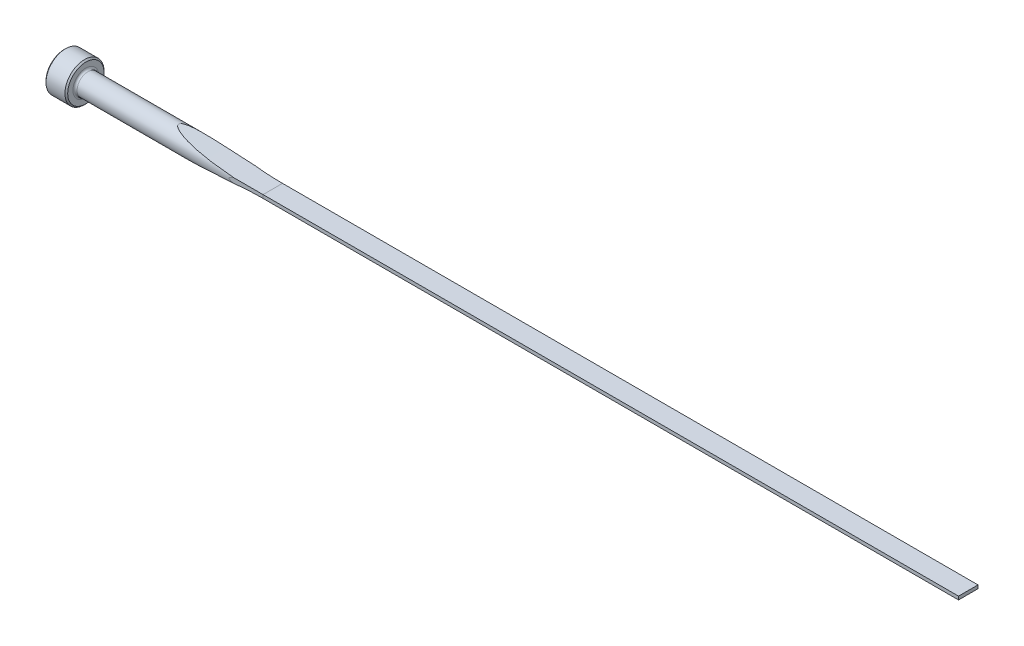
ISO-10303-21;
HEADER;
FILE_DESCRIPTION(('STEP AP214'),'2;1');
FILE_NAME('part.step','',(''),(''),'','','');
FILE_SCHEMA(('AUTOMOTIVE_DESIGN { 1 0 10303 214 1 1 1 1 }'));
ENDSEC;
DATA;
#1=APPLICATION_CONTEXT('core data for automotive mechanical design processes');
#2=APPLICATION_PROTOCOL_DEFINITION('international standard','automotive_design',2000,#1);
#3=PRODUCT_CONTEXT('',#1,'mechanical');
#4=PRODUCT('Part','Part','',(#3));
#5=PRODUCT_RELATED_PRODUCT_CATEGORY('part','',(#4));
#6=PRODUCT_DEFINITION_FORMATION('','',#4);
#7=PRODUCT_DEFINITION_CONTEXT('part definition',#1,'design');
#8=PRODUCT_DEFINITION('design','',#6,#7);
#9=PRODUCT_DEFINITION_SHAPE('','',#8);
#10=(LENGTH_UNIT() NAMED_UNIT(*) SI_UNIT(.MILLI.,.METRE.));
#11=(NAMED_UNIT(*) PLANE_ANGLE_UNIT() SI_UNIT($,.RADIAN.));
#12=(NAMED_UNIT(*) SI_UNIT($,.STERADIAN.) SOLID_ANGLE_UNIT());
#13=UNCERTAINTY_MEASURE_WITH_UNIT(LENGTH_MEASURE(1.E-05),#10,'distance_accuracy_value','');
#14=(GEOMETRIC_REPRESENTATION_CONTEXT(3) GLOBAL_UNCERTAINTY_ASSIGNED_CONTEXT((#13)) GLOBAL_UNIT_ASSIGNED_CONTEXT((#10,
#11,#12)) REPRESENTATION_CONTEXT('',''));
#15=CARTESIAN_POINT('',(0.,0.,0.));
#16=DIRECTION('',(0.,0.,1.));
#17=DIRECTION('',(1.,0.,0.));
#18=AXIS2_PLACEMENT_3D('',#15,#16,#17);
#19=CARTESIAN_POINT('',(0.,0.,0.));
#20=DIRECTION('',(-1.,0.,0.));
#21=DIRECTION('',(0.,0.,1.));
#22=AXIS2_PLACEMENT_3D('',#19,#20,#21);
#23=CYLINDRICAL_SURFACE('',#22,1.9812);
#24=CARTESIAN_POINT('',(4.3434,0.,0.));
#25=DIRECTION('',(-1.,0.,0.));
#26=DIRECTION('',(0.,0.,1.));
#27=AXIS2_PLACEMENT_3D('',#24,#25,#26);
#28=CIRCLE('',#27,1.9812);
#29=CARTESIAN_POINT('',(4.3434,0.,1.9812));
#30=VERTEX_POINT('',#29);
#31=EDGE_CURVE('E152',#30,#30,#28,.F.);
#32=ORIENTED_EDGE('',*,*,#31,.T.);
#33=EDGE_LOOP('',(#32));
#34=FACE_BOUND('',#33,.T.);
#35=CARTESIAN_POINT('',(38.1,0.873996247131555,1.77799999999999));
#36=CARTESIAN_POINT('',(37.9334542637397,0.873989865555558,1.77799993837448));
#37=CARTESIAN_POINT('',(37.7669097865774,0.873044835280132,1.77846802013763));
#38=CARTESIAN_POINT('',(37.4338428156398,0.869223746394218,1.78033991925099));
#39=CARTESIAN_POINT('',(37.2673203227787,0.866347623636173,1.78174376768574));
#40=CARTESIAN_POINT('',(36.7674068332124,0.854732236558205,1.78736286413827));
#41=CARTESIAN_POINT('',(36.4340948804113,0.8430056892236,1.7929856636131));
#42=CARTESIAN_POINT('',(35.7727863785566,0.810634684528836,1.80785962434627));
#43=CARTESIAN_POINT('',(35.4447825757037,0.79012144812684,1.81705721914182));
#44=CARTESIAN_POINT('',(34.9536671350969,0.750641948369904,1.83354371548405));
#45=CARTESIAN_POINT('',(34.7901577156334,0.736036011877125,1.83948544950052));
#46=CARTESIAN_POINT('',(34.4635315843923,0.703289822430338,1.85225599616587));
#47=CARTESIAN_POINT('',(34.3004148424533,0.685149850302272,1.85908473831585));
#48=CARTESIAN_POINT('',(34.0296562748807,0.651228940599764,1.87116478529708));
#49=CARTESIAN_POINT('',(33.9218452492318,0.636713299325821,1.8761721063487));
#50=CARTESIAN_POINT('',(33.7065408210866,0.605233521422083,1.88656384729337));
#51=CARTESIAN_POINT('',(33.5990475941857,0.588268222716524,1.8919484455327));
#52=CARTESIAN_POINT('',(33.3835275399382,0.551010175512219,1.9031350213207));
#53=CARTESIAN_POINT('',(33.2755064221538,0.530685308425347,1.90894069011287));
#54=CARTESIAN_POINT('',(33.0604889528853,0.485692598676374,1.92088824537));
#55=CARTESIAN_POINT('',(32.9534914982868,0.461030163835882,1.92702970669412));
#56=CARTESIAN_POINT('',(32.7938896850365,0.418829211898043,1.93647603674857));
#57=CARTESIAN_POINT('',(32.7406123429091,0.403818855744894,1.93967803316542));
#58=CARTESIAN_POINT('',(32.6346066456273,0.371424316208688,1.94614386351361));
#59=CARTESIAN_POINT('',(32.5818801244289,0.354033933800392,1.94940783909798));
#60=CARTESIAN_POINT('',(32.4782386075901,0.316094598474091,1.95591437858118));
#61=CARTESIAN_POINT('',(32.4273101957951,0.295581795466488,1.95915679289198));
#62=CARTESIAN_POINT('',(32.3278405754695,0.249491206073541,1.9655736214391));
#63=CARTESIAN_POINT('',(32.2792877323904,0.223942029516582,1.96874831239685));
#64=CARTESIAN_POINT('',(32.2167619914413,0.181702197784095,1.97288277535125));
#65=CARTESIAN_POINT('',(32.1999648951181,0.169297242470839,1.97399869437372));
#66=CARTESIAN_POINT('',(32.1681376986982,0.142414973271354,1.97612145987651));
#67=CARTESIAN_POINT('',(32.1530993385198,0.127948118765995,1.97712881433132));
#68=CARTESIAN_POINT('',(32.1334076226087,0.104576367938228,1.97845199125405));
#69=CARTESIAN_POINT('',(32.1274666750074,0.0967736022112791,1.97885188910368));
#70=CARTESIAN_POINT('',(32.116621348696,0.0804504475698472,1.97958282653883));
#71=CARTESIAN_POINT('',(32.1117177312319,0.0719295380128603,1.9799138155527));
#72=CARTESIAN_POINT('',(32.1032905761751,0.0540450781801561,1.9804831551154));
#73=CARTESIAN_POINT('',(32.0997893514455,0.0446706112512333,1.98072000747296));
#74=CARTESIAN_POINT('',(32.0947628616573,0.0254116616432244,1.98106017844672));
#75=CARTESIAN_POINT('',(32.0932312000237,0.0155289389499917,1.98116392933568));
#76=CARTESIAN_POINT('',(32.0924621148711,-0.00283989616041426,1.98121601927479));
#77=CARTESIAN_POINT('',(32.0929156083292,-0.0113136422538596,1.98118529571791));
#78=CARTESIAN_POINT('',(32.0953671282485,-0.0280374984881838,1.98101929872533));
#79=CARTESIAN_POINT('',(32.0973672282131,-0.0362872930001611,1.98088388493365));
#80=CARTESIAN_POINT('',(32.1032599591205,-0.0541083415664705,1.98048527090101));
#81=CARTESIAN_POINT('',(32.1074720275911,-0.0635712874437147,1.98020051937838));
#82=CARTESIAN_POINT('',(32.1173271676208,-0.081709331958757,1.97953524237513));
#83=CARTESIAN_POINT('',(32.1229731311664,-0.0903827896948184,1.97915452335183));
#84=CARTESIAN_POINT('',(32.1399709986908,-0.113337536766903,1.97801031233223));
#85=CARTESIAN_POINT('',(32.1523792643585,-0.126821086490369,1.97717711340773));
#86=CARTESIAN_POINT('',(32.178895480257,-0.151968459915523,1.97540307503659));
#87=CARTESIAN_POINT('',(32.1930088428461,-0.163626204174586,1.97446189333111));
#88=CARTESIAN_POINT('',(32.2308983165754,-0.19208509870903,1.97194504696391));
#89=CARTESIAN_POINT('',(32.2554459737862,-0.207842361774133,1.97032379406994));
#90=CARTESIAN_POINT('',(32.3058684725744,-0.237095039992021,1.96701597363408));
#91=CARTESIAN_POINT('',(32.331746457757,-0.250584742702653,1.9653292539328));
#92=CARTESIAN_POINT('',(32.4107777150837,-0.288767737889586,1.96021411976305));
#93=CARTESIAN_POINT('',(32.4650936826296,-0.311024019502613,1.95674636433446));
#94=CARTESIAN_POINT('',(32.5833217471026,-0.354812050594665,1.94931073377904));
#95=CARTESIAN_POINT('',(32.6474477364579,-0.375730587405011,1.94534614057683));
#96=CARTESIAN_POINT('',(32.7766973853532,-0.41429027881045,1.93749827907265));
#97=CARTESIAN_POINT('',(32.8418214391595,-0.431930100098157,1.93361504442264));
#98=CARTESIAN_POINT('',(33.0383860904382,-0.481456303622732,1.92211396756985));
#99=CARTESIAN_POINT('',(33.1707045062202,-0.509845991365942,1.91466459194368));
#100=CARTESIAN_POINT('',(33.4364278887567,-0.560951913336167,1.90030665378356));
#101=CARTESIAN_POINT('',(33.5698330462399,-0.583667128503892,1.89339818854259));
#102=CARTESIAN_POINT('',(33.8371090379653,-0.624985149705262,1.88016424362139));
#103=CARTESIAN_POINT('',(33.9709789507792,-0.643593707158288,1.87383795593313));
#104=CARTESIAN_POINT('',(34.2612886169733,-0.680513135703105,1.86077894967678));
#105=CARTESIAN_POINT('',(34.4178028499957,-0.698266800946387,1.85415178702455));
#106=CARTESIAN_POINT('',(34.7312113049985,-0.730437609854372,1.84171312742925));
#107=CARTESIAN_POINT('',(34.8881055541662,-0.744854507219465,1.83590169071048));
#108=CARTESIAN_POINT('',(35.3593917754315,-0.78401015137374,1.81969752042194));
#109=CARTESIAN_POINT('',(35.674170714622,-0.804628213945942,1.81054467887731));
#110=CARTESIAN_POINT('',(36.303676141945,-0.83743822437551,1.79559337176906));
#111=CARTESIAN_POINT('',(36.6184017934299,-0.849644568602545,1.78978917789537));
#112=CARTESIAN_POINT('',(37.2480072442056,-0.866841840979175,1.78152544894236));
#113=CARTESIAN_POINT('',(37.562886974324,-0.8718348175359,1.77906496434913));
#114=CARTESIAN_POINT('',(37.9518520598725,-0.8738064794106,1.77809255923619));
#115=CARTESIAN_POINT('',(38.0259264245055,-0.873993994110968,1.77799996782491));
#116=CARTESIAN_POINT('',(38.1,-0.873996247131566,1.77799999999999));
#117=B_SPLINE_CURVE_WITH_KNOTS('',3,(#35,#36,#37,#38,#39,#40,#41,#42,#43,#44,#45,#46,#47,#48,
#49,#50,#51,#52,#53,#54,#55,#56,#57,#58,#59,#60,#61,#62,#63,#64,#65,#66,#67,#68,#69,#70,#71,#72,
#73,#74,#75,#76,#77,#78,#79,#80,#81,#82,#83,#84,#85,#86,#87,#88,#89,#90,#91,#92,#93,#94,#95,#96,
#97,#98,#99,#100,#101,#102,#103,#104,#105,#106,#107,#108,#109,#110,#111,#112,#113,#114,#115,
#116),.UNSPECIFIED.,.F.,.F.,(4,2,2,2,2,2,2,2,2,2,2,2,2,2,2,2,2,2,2,2,2,2,2,2,2,2,2,2,2,2,2,2,2,
2,2,2,2,2,2,2,4),(0.,0.499631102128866,0.999278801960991,1.9998489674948,2.98597077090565,
3.47874557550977,3.97148123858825,4.29815737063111,4.62498898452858,4.95514810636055,
5.28489848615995,5.4512016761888,5.61794656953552,5.78289019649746,5.94692252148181,
6.00956538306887,6.07190109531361,6.10128690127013,6.1306941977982,6.1605523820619,
6.1903133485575,6.21561974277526,6.24096012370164,6.27187252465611,6.30284777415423,
6.35756673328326,6.41246418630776,6.49988097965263,6.58751479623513,6.76361391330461,
6.96621737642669,7.16890304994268,7.57526706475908,7.98170400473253,8.38756806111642,
8.86049226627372,9.33345136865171,10.2800238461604,11.2249722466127,12.1696522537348,
12.3918748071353),.UNSPECIFIED.);
#118=CARTESIAN_POINT('',(32.9338167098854,0.455036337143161,1.92823633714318));
#119=VERTEX_POINT('',#118);
#120=CARTESIAN_POINT('',(32.9338167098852,-0.455036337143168,1.92823633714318));
#121=VERTEX_POINT('',#120);
#122=EDGE_CURVE('E155',#119,#121,#117,.T.);
#123=ORIENTED_EDGE('',*,*,#122,.F.);
#124=CARTESIAN_POINT('',(38.1,0.30479999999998,1.95761344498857));
#125=CARTESIAN_POINT('',(37.7695529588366,0.304799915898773,1.95760214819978));
#126=CARTESIAN_POINT('',(37.4391059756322,0.306642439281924,1.95732626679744));
#127=CARTESIAN_POINT('',(36.7782488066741,0.314012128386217,1.95616343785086));
#128=CARTESIAN_POINT('',(36.4478386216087,0.319539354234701,1.955276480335));
#129=CARTESIAN_POINT('',(35.7873759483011,0.334271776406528,1.9528106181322));
#130=CARTESIAN_POINT('',(35.4573233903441,0.343473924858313,1.95123228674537));
#131=CARTESIAN_POINT('',(34.7973526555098,0.365554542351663,1.94721514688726));
#132=CARTESIAN_POINT('',(34.4674344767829,0.378432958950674,1.94477635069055));
#133=CARTESIAN_POINT('',(33.4774271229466,0.422603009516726,1.93584291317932));
#134=CARTESIAN_POINT('',(32.8175895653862,0.459418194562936,1.92773248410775));
#135=CARTESIAN_POINT('',(31.4988858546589,0.547752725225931,1.90452801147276));
#136=CARTESIAN_POINT('',(30.8400198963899,0.599274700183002,1.88943271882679));
#137=CARTESIAN_POINT('',(29.8521569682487,0.687610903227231,1.85830630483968));
#138=CARTESIAN_POINT('',(29.5225308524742,0.718944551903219,1.84649686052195));
#139=CARTESIAN_POINT('',(28.8637987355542,0.785276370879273,1.81928179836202));
#140=CARTESIAN_POINT('',(28.5346927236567,0.820274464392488,1.80387625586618));
#141=CARTESIAN_POINT('',(27.8772626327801,0.89390032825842,1.76854848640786));
#142=CARTESIAN_POINT('',(27.548938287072,0.932526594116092,1.74862812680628));
#143=CARTESIAN_POINT('',(26.8931454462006,1.01338569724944,1.70304380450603));
#144=CARTESIAN_POINT('',(26.5656769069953,1.05561834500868,1.67738014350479));
#145=CARTESIAN_POINT('',(25.9107084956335,1.14379434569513,1.6185564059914));
#146=CARTESIAN_POINT('',(25.5832125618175,1.18975022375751,1.58537028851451));
#147=CARTESIAN_POINT('',(25.0930833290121,1.26131005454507,1.52812761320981));
#148=CARTESIAN_POINT('',(24.9298235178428,1.28561189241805,1.50779256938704));
#149=CARTESIAN_POINT('',(24.6038270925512,1.33506408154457,1.46418845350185));
#150=CARTESIAN_POINT('',(24.4410904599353,1.36021440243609,1.44091948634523));
#151=CARTESIAN_POINT('',(24.1169309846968,1.41123193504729,1.3909878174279));
#152=CARTESIAN_POINT('',(23.9555054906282,1.43709587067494,1.36433908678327));
#153=CARTESIAN_POINT('',(23.6335346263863,1.48959050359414,1.30682557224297));
#154=CARTESIAN_POINT('',(23.4729891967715,1.51622114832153,1.27596107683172));
#155=CARTESIAN_POINT('',(23.1533253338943,1.57014271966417,1.2089879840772));
#156=CARTESIAN_POINT('',(22.994205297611,1.59743272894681,1.1728863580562));
#157=CARTESIAN_POINT('',(22.6777930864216,1.65257970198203,1.09383659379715));
#158=CARTESIAN_POINT('',(22.5205001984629,1.68043643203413,1.05089122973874));
#159=CARTESIAN_POINT('',(22.286608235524,1.72249921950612,0.979238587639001));
#160=CARTESIAN_POINT('',(22.2088921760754,1.73658373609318,0.95411361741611));
#161=CARTESIAN_POINT('',(22.0544398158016,1.76478536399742,0.90088724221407));
#162=CARTESIAN_POINT('',(21.9777040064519,1.77890248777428,0.872784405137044));
#163=CARTESIAN_POINT('',(21.825441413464,1.80711840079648,0.812762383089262));
#164=CARTESIAN_POINT('',(21.7499188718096,1.82121701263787,0.780832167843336));
#165=CARTESIAN_POINT('',(21.6011654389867,1.84918092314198,0.712082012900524));
#166=CARTESIAN_POINT('',(21.527932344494,1.86304643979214,0.675266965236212));
#167=CARTESIAN_POINT('',(21.384226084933,1.89043542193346,0.594374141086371));
#168=CARTESIAN_POINT('',(21.3137920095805,1.90395346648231,0.550221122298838));
#169=CARTESIAN_POINT('',(21.213895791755,1.92324041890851,0.476369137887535));
#170=CARTESIAN_POINT('',(21.1816570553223,1.92948463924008,0.450582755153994));
#171=CARTESIAN_POINT('',(21.1199681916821,1.94146580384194,0.395795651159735));
#172=CARTESIAN_POINT('',(21.0905122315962,1.94720380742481,0.366801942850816));
#173=CARTESIAN_POINT('',(21.0449514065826,1.95609990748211,0.315066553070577));
#174=CARTESIAN_POINT('',(21.0276518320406,1.95948383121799,0.293426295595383));
#175=CARTESIAN_POINT('',(20.9957337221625,1.96573570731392,0.248113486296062));
#176=CARTESIAN_POINT('',(20.9811174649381,1.9686032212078,0.224439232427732));
#177=CARTESIAN_POINT('',(20.9554498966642,1.9736440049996,0.174685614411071));
#178=CARTESIAN_POINT('',(20.9444506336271,1.97580713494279,0.148577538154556));
#179=CARTESIAN_POINT('',(20.9276253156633,1.97911786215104,0.0946961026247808));
#180=CARTESIAN_POINT('',(20.9217844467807,1.98026836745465,0.0669277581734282));
#181=CARTESIAN_POINT('',(20.9165018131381,1.98130891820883,0.0138732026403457));
#182=CARTESIAN_POINT('',(20.9164211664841,1.98132480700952,-0.0113459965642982));
#183=CARTESIAN_POINT('',(20.9210718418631,1.98040873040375,-0.0613254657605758));
#184=CARTESIAN_POINT('',(20.9258075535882,1.97947590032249,-0.0860852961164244));
#185=CARTESIAN_POINT('',(20.9402302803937,1.97663734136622,-0.137050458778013));
#186=CARTESIAN_POINT('',(20.9504133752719,1.97463416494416,-0.163106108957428));
#187=CARTESIAN_POINT('',(20.9747360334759,1.96985580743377,-0.213208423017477));
#188=CARTESIAN_POINT('',(20.9888827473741,1.96707923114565,-0.237251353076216));
#189=CARTESIAN_POINT('',(21.0304351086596,1.95893680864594,-0.29871400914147));
#190=CARTESIAN_POINT('',(21.0603806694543,1.95308118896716,-0.334326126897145));
#191=CARTESIAN_POINT('',(21.1248654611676,1.94051232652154,-0.400890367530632));
#192=CARTESIAN_POINT('',(21.1594183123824,1.93379654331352,-0.431828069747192));
#193=CARTESIAN_POINT('',(21.247369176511,1.91676173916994,-0.503050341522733));
#194=CARTESIAN_POINT('',(21.3023002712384,1.90617130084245,-0.541351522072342));
#195=CARTESIAN_POINT('',(21.4154712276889,1.88447103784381,-0.612617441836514));
#196=CARTESIAN_POINT('',(21.4737182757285,1.87336009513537,-0.645569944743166));
#197=CARTESIAN_POINT('',(21.5925740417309,1.85081574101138,-0.707621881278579));
#198=CARTESIAN_POINT('',(21.6531941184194,1.83938087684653,-0.736698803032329));
#199=CARTESIAN_POINT('',(21.7757398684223,1.81640018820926,-0.791659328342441));
#200=CARTESIAN_POINT('',(21.8376640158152,1.80485450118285,-0.817546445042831));
#201=CARTESIAN_POINT('',(22.023340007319,1.77044354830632,-0.890840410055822));
#202=CARTESIAN_POINT('',(22.1485077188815,1.74751721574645,-0.934620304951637));
#203=CARTESIAN_POINT('',(22.4010625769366,1.70182929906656,-1.01541106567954));
#204=CARTESIAN_POINT('',(22.5284511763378,1.67906783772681,-1.05241730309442));
#205=CARTESIAN_POINT('',(22.784941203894,1.63382325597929,-1.12137347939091));
#206=CARTESIAN_POINT('',(22.9140458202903,1.61134087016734,-1.15331194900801));
#207=CARTESIAN_POINT('',(23.1732653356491,1.56679514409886,-1.21313375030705));
#208=CARTESIAN_POINT('',(23.3033803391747,1.5447318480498,-1.24101665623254));
#209=CARTESIAN_POINT('',(23.5644971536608,1.50105606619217,-1.29350297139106));
#210=CARTESIAN_POINT('',(23.6954997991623,1.47944411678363,-1.31810264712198));
#211=CARTESIAN_POINT('',(23.9580829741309,1.43673132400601,-1.36453310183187));
#212=CARTESIAN_POINT('',(24.0896635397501,1.41563051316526,-1.38636370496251));
#213=CARTESIAN_POINT('',(24.3530824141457,1.37399668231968,-1.42763591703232));
#214=CARTESIAN_POINT('',(24.4849200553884,1.35346286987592,-1.44708100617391));
#215=CARTESIAN_POINT('',(24.748958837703,1.31294860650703,-1.48393649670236));
#216=CARTESIAN_POINT('',(24.8811599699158,1.29296814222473,-1.50134694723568));
#217=CARTESIAN_POINT('',(25.2723123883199,1.23475465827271,-1.55018456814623));
#218=CARTESIAN_POINT('',(25.53169601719,1.19731998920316,-1.57911231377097));
#219=CARTESIAN_POINT('',(26.0513195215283,1.12467659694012,-1.63164236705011));
#220=CARTESIAN_POINT('',(26.3115594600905,1.08946804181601,-1.65524427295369));
#221=CARTESIAN_POINT('',(26.832751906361,1.02130830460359,-1.69814758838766));
#222=CARTESIAN_POINT('',(27.0937045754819,0.98835768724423,-1.71744792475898));
#223=CARTESIAN_POINT('',(27.6161283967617,0.924747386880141,-1.75251500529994));
#224=CARTESIAN_POINT('',(27.8775995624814,0.894087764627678,-1.768281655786));
#225=CARTESIAN_POINT('',(28.6634038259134,0.805485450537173,-1.81126838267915));
#226=CARTESIAN_POINT('',(29.1883717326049,0.751018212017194,-1.83411690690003));
#227=CARTESIAN_POINT('',(30.2393832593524,0.651429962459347,-1.87179092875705));
#228=CARTESIAN_POINT('',(30.7654267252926,0.6063076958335,-1.88661750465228));
#229=CARTESIAN_POINT('',(31.8175815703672,0.525494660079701,-1.91070223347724));
#230=CARTESIAN_POINT('',(32.3436917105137,0.489790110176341,-1.9199685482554));
#231=CARTESIAN_POINT('',(33.3965332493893,0.427744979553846,-1.93473547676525));
#232=CARTESIAN_POINT('',(33.9232646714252,0.401404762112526,-1.94023594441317));
#233=CARTESIAN_POINT('',(34.976795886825,0.358115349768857,-1.94868973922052));
#234=CARTESIAN_POINT('',(35.5035954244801,0.341160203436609,-1.95164468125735));
#235=CARTESIAN_POINT('',(36.5574038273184,0.31662216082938,-1.95577596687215));
#236=CARTESIAN_POINT('',(37.0844126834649,0.309038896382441,-1.95695238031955));
#237=CARTESIAN_POINT('',(37.6928687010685,0.305694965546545,-1.95747371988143));
#238=CARTESIAN_POINT('',(37.774300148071,0.305359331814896,-1.95752618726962));
#239=CARTESIAN_POINT('',(37.9371543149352,0.304911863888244,-1.95759613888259));
#240=CARTESIAN_POINT('',(38.0185770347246,0.304800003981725,-1.95761362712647));
#241=CARTESIAN_POINT('',(38.1,0.304799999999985,-1.95761344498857));
#242=B_SPLINE_CURVE_WITH_KNOTS('',3,(#124,#125,#126,#127,#128,#129,#130,#131,#132,#133,#134,
#135,#136,#137,#138,#139,#140,#141,#142,#143,#144,#145,#146,#147,#148,#149,#150,#151,#152,#153,
#154,#155,#156,#157,#158,#159,#160,#161,#162,#163,#164,#165,#166,#167,#168,#169,#170,#171,#172,
#173,#174,#175,#176,#177,#178,#179,#180,#181,#182,#183,#184,#185,#186,#187,#188,#189,#190,#191,
#192,#193,#194,#195,#196,#197,#198,#199,#200,#201,#202,#203,#204,#205,#206,#207,#208,#209,#210,
#211,#212,#213,#214,#215,#216,#217,#218,#219,#220,#221,#222,#223,#224,#225,#226,#227,#228,#229,
#230,#231,#232,#233,#234,#235,#236,#237,#238,#239,#240,#241),.UNSPECIFIED.,.F.,.F.,(4,2,2,2,2,2,
2,2,2,2,2,2,2,2,2,2,2,2,2,2,2,2,2,2,2,2,2,2,2,2,2,2,2,2,2,2,2,2,2,2,2,2,2,2,2,2,2,2,2,2,2,2,2,2,
2,2,2,2,4),(0.,0.991335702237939,1.98268758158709,2.97321896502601,3.96373621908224,
5.94628404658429,7.92918654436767,8.92312202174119,9.91703667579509,10.9105409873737,
11.9039931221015,12.9009383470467,13.3998353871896,13.8987145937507,14.3955949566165,
14.892441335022,15.3886323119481,15.8846226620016,16.1332234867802,16.3819444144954,
16.6314002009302,16.8806080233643,17.1325496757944,17.2576650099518,17.3825119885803,
17.4660899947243,17.5497386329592,17.6345430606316,17.7191031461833,17.7942680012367,
17.8695014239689,17.9531791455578,18.0370088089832,18.1769027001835,18.3172197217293,
18.5201034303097,18.7234449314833,18.9279203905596,19.1321685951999,19.5355570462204,
19.939220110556,20.343784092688,20.748390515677,21.1534531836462,21.5585415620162,
21.9630317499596,22.3675121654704,23.1584106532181,23.9493687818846,24.7405240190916,
25.531700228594,27.1163456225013,28.7007779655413,30.2828788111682,31.8650410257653,
33.44619877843,35.027294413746,35.2715908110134,35.515859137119),.UNSPECIFIED.);
#243=CARTESIAN_POINT('',(32.9338167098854,0.455036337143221,-1.92823633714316));
#244=VERTEX_POINT('',#243);
#245=EDGE_CURVE('E105',#119,#244,#242,.T.);
#246=ORIENTED_EDGE('',*,*,#245,.T.);
#247=CARTESIAN_POINT('',(38.1,0.873996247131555,-1.77799999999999));
#248=CARTESIAN_POINT('',(37.9334542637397,0.873989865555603,-1.77799993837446));
#249=CARTESIAN_POINT('',(37.7669097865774,0.873044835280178,-1.77846802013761));
#250=CARTESIAN_POINT('',(37.4338428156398,0.869223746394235,-1.78033991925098));
#251=CARTESIAN_POINT('',(37.2673203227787,0.86634762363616,-1.78174376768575));
#252=CARTESIAN_POINT('',(36.7674068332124,0.854732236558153,-1.78736286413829));
#253=CARTESIAN_POINT('',(36.4340948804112,0.843005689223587,-1.7929856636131));
#254=CARTESIAN_POINT('',(35.7727863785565,0.81063468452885,-1.80785962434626));
#255=CARTESIAN_POINT('',(35.4447825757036,0.790121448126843,-1.81705721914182));
#256=CARTESIAN_POINT('',(34.9536671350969,0.750641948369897,-1.83354371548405));
#257=CARTESIAN_POINT('',(34.7901577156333,0.736036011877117,-1.83948544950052));
#258=CARTESIAN_POINT('',(34.4635315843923,0.703289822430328,-1.85225599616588));
#259=CARTESIAN_POINT('',(34.3004148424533,0.685149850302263,-1.85908473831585));
#260=CARTESIAN_POINT('',(34.0296562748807,0.651228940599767,-1.87116478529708));
#261=CARTESIAN_POINT('',(33.9218452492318,0.63671329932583,-1.8761721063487));
#262=CARTESIAN_POINT('',(33.7065408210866,0.605233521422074,-1.88656384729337));
#263=CARTESIAN_POINT('',(33.5990475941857,0.588268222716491,-1.89194844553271));
#264=CARTESIAN_POINT('',(33.3835275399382,0.551010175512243,-1.9031350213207));
#265=CARTESIAN_POINT('',(33.2755064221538,0.530685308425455,-1.90894069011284));
#266=CARTESIAN_POINT('',(33.0604889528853,0.485692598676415,-1.92088824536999));
#267=CARTESIAN_POINT('',(32.9534914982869,0.461030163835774,-1.92702970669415));
#268=CARTESIAN_POINT('',(32.7938896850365,0.418829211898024,-1.93647603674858));
#269=CARTESIAN_POINT('',(32.7406123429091,0.403818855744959,-1.93967803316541));
#270=CARTESIAN_POINT('',(32.6346066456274,0.37142431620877,-1.9461438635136));
#271=CARTESIAN_POINT('',(32.581880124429,0.354033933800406,-1.94940783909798));
#272=CARTESIAN_POINT('',(32.4782386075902,0.316094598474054,-1.95591437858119));
#273=CARTESIAN_POINT('',(32.4273101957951,0.295581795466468,-1.95915679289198));
#274=CARTESIAN_POINT('',(32.3278405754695,0.249491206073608,-1.96557362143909));
#275=CARTESIAN_POINT('',(32.2792877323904,0.223942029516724,-1.96874831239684));
#276=CARTESIAN_POINT('',(32.2167619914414,0.18170219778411,-1.97288277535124));
#277=CARTESIAN_POINT('',(32.1999648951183,0.169297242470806,-1.97399869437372));
#278=CARTESIAN_POINT('',(32.1681376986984,0.142414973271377,-1.97612145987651));
#279=CARTESIAN_POINT('',(32.15309933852,0.12794811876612,-1.97712881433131));
#280=CARTESIAN_POINT('',(32.1334076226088,0.104576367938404,-1.97845199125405));
#281=CARTESIAN_POINT('',(32.1274666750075,0.096773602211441,-1.97885188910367));
#282=CARTESIAN_POINT('',(32.1166213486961,0.0804504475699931,-1.97958282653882));
#283=CARTESIAN_POINT('',(32.1117177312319,0.0719295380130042,-1.9799138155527));
#284=CARTESIAN_POINT('',(32.1032905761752,0.0540450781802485,-1.9804831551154));
#285=CARTESIAN_POINT('',(32.0997893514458,0.0446706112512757,-1.98072000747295));
#286=CARTESIAN_POINT('',(32.0947628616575,0.0254116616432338,-1.98106017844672));
#287=CARTESIAN_POINT('',(32.0932312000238,0.015528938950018,-1.98116392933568));
#288=CARTESIAN_POINT('',(32.0924621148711,-0.00283989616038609,-1.98121601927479));
#289=CARTESIAN_POINT('',(32.0929156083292,-0.0113136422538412,-1.98118529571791));
#290=CARTESIAN_POINT('',(32.0953671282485,-0.0280374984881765,-1.98101929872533));
#291=CARTESIAN_POINT('',(32.0973672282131,-0.0362872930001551,-1.98088388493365));
#292=CARTESIAN_POINT('',(32.1032599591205,-0.0541083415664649,-1.98048527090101));
#293=CARTESIAN_POINT('',(32.1074720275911,-0.0635712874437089,-1.98020051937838));
#294=CARTESIAN_POINT('',(32.1173271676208,-0.0817093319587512,-1.97953524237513));
#295=CARTESIAN_POINT('',(32.1229731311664,-0.0903827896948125,-1.97915452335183));
#296=CARTESIAN_POINT('',(32.1399709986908,-0.1133375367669,-1.97801031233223));
#297=CARTESIAN_POINT('',(32.1523792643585,-0.126821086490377,-1.97717711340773));
#298=CARTESIAN_POINT('',(32.1788954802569,-0.151968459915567,-1.97540307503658));
#299=CARTESIAN_POINT('',(32.193008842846,-0.163626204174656,-1.9744618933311));
#300=CARTESIAN_POINT('',(32.2308983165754,-0.192085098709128,-1.9719450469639));
#301=CARTESIAN_POINT('',(32.2554459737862,-0.207842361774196,-1.97032379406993));
#302=CARTESIAN_POINT('',(32.3058684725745,-0.237095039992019,-1.96701597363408));
#303=CARTESIAN_POINT('',(32.3317464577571,-0.250584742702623,-1.96532925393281));
#304=CARTESIAN_POINT('',(32.4107777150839,-0.288767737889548,-1.96021411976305));
#305=CARTESIAN_POINT('',(32.4650936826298,-0.311024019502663,-1.95674636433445));
#306=CARTESIAN_POINT('',(32.583321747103,-0.354812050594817,-1.94931073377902));
#307=CARTESIAN_POINT('',(32.6474477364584,-0.375730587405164,-1.9453461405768));
#308=CARTESIAN_POINT('',(32.7766973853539,-0.414290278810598,-1.93749827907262));
#309=CARTESIAN_POINT('',(32.8418214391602,-0.431930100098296,-1.93361504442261));
#310=CARTESIAN_POINT('',(33.0383860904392,-0.48145630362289,-1.92211396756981));
#311=CARTESIAN_POINT('',(33.1707045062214,-0.509845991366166,-1.91466459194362));
#312=CARTESIAN_POINT('',(33.4364278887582,-0.560951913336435,-1.90030665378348));
#313=CARTESIAN_POINT('',(33.5698330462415,-0.583667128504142,-1.89339818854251));
#314=CARTESIAN_POINT('',(33.8371090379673,-0.624985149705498,-1.88016424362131));
#315=CARTESIAN_POINT('',(33.9709789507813,-0.643593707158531,-1.87383795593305));
#316=CARTESIAN_POINT('',(34.2612886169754,-0.680513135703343,-1.86077894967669));
#317=CARTESIAN_POINT('',(34.4178028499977,-0.698266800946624,-1.85415178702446));
#318=CARTESIAN_POINT('',(34.7312113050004,-0.730437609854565,-1.84171312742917));
#319=CARTESIAN_POINT('',(34.888105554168,-0.744854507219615,-1.83590169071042));
#320=CARTESIAN_POINT('',(35.359391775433,-0.784010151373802,-1.81969752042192));
#321=CARTESIAN_POINT('',(35.6741707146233,-0.804628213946,-1.81054467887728));
#322=CARTESIAN_POINT('',(36.3036761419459,-0.83743822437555,-1.79559337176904));
#323=CARTESIAN_POINT('',(36.6184017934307,-0.849644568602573,-1.78978917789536));
#324=CARTESIAN_POINT('',(37.2480072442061,-0.866841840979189,-1.78152544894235));
#325=CARTESIAN_POINT('',(37.5628869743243,-0.871834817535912,-1.77906496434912));
#326=CARTESIAN_POINT('',(37.9518520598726,-0.87380647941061,-1.77809255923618));
#327=CARTESIAN_POINT('',(38.0259264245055,-0.873993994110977,-1.7779999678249));
#328=CARTESIAN_POINT('',(38.1,-0.873996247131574,-1.77799999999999));
#329=B_SPLINE_CURVE_WITH_KNOTS('',3,(#247,#248,#249,#250,#251,#252,#253,#254,#255,#256,#257,
#258,#259,#260,#261,#262,#263,#264,#265,#266,#267,#268,#269,#270,#271,#272,#273,#274,#275,#276,
#277,#278,#279,#280,#281,#282,#283,#284,#285,#286,#287,#288,#289,#290,#291,#292,#293,#294,#295,
#296,#297,#298,#299,#300,#301,#302,#303,#304,#305,#306,#307,#308,#309,#310,#311,#312,#313,#314,
#315,#316,#317,#318,#319,#320,#321,#322,#323,#324,#325,#326,#327,#328),.UNSPECIFIED.,.F.,.F.,(4,
2,2,2,2,2,2,2,2,2,2,2,2,2,2,2,2,2,2,2,2,2,2,2,2,2,2,2,2,2,2,2,2,2,2,2,2,2,2,2,4),(0.,
0.499631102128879,0.99927880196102,1.99984896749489,2.98597077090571,3.4787455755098,
3.97148123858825,4.29815737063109,4.62498898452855,4.95514810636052,5.28489848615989,
5.45120167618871,5.61794656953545,5.7828901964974,5.94692252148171,6.00956538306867,
6.07190109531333,6.1012869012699,6.13069419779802,6.16055238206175,6.19031334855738,
6.21561974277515,6.24096012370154,6.27187252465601,6.30284777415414,6.35756673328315,
6.41246418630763,6.49988097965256,6.58751479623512,6.7636139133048,6.96621737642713,
7.16890304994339,7.57526706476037,7.98170400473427,8.38756806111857,8.8604922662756,
9.33345136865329,10.2800238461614,11.2249722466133,12.1696522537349,12.3918748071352),.UNSPECIFIED.);
#330=CARTESIAN_POINT('',(32.9338167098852,-0.455036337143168,-1.92823633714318));
#331=VERTEX_POINT('',#330);
#332=EDGE_CURVE('E174',#244,#331,#329,.T.);
#333=ORIENTED_EDGE('',*,*,#332,.T.);
#334=CARTESIAN_POINT('',(38.1,-0.30479999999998,1.95761344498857));
#335=CARTESIAN_POINT('',(37.7695529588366,-0.304799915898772,1.95760214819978));
#336=CARTESIAN_POINT('',(37.4391059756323,-0.306642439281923,1.95732626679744));
#337=CARTESIAN_POINT('',(36.7782488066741,-0.314012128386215,1.95616343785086));
#338=CARTESIAN_POINT('',(36.4478386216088,-0.319539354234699,1.955276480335));
#339=CARTESIAN_POINT('',(35.7873759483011,-0.334271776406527,1.9528106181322));
#340=CARTESIAN_POINT('',(35.4573233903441,-0.343473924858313,1.95123228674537));
#341=CARTESIAN_POINT('',(34.7973526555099,-0.365554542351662,1.94721514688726));
#342=CARTESIAN_POINT('',(34.4674344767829,-0.37843295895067,1.94477635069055));
#343=CARTESIAN_POINT('',(33.4774271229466,-0.422603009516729,1.93584291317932));
#344=CARTESIAN_POINT('',(32.8175895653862,-0.459418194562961,1.92773248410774));
#345=CARTESIAN_POINT('',(31.4988858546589,-0.547752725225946,1.90452801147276));
#346=CARTESIAN_POINT('',(30.84001989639,-0.599274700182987,1.88943271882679));
#347=CARTESIAN_POINT('',(29.8521569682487,-0.68761090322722,1.85830630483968));
#348=CARTESIAN_POINT('',(29.5225308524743,-0.718944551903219,1.84649686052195));
#349=CARTESIAN_POINT('',(28.8637987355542,-0.785276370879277,1.81928179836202));
#350=CARTESIAN_POINT('',(28.5346927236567,-0.820274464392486,1.80387625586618));
#351=CARTESIAN_POINT('',(27.8772626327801,-0.893900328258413,1.76854848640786));
#352=CARTESIAN_POINT('',(27.5489382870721,-0.932526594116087,1.74862812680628));
#353=CARTESIAN_POINT('',(26.8931454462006,-1.01338569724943,1.70304380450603));
#354=CARTESIAN_POINT('',(26.5656769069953,-1.05561834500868,1.67738014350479));
#355=CARTESIAN_POINT('',(25.9107084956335,-1.14379434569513,1.6185564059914));
#356=CARTESIAN_POINT('',(25.5832125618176,-1.18975022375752,1.58537028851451));
#357=CARTESIAN_POINT('',(25.0930833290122,-1.26131005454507,1.52812761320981));
#358=CARTESIAN_POINT('',(24.9298235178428,-1.28561189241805,1.50779256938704));
#359=CARTESIAN_POINT('',(24.6038270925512,-1.33506408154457,1.46418845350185));
#360=CARTESIAN_POINT('',(24.4410904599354,-1.36021440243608,1.44091948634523));
#361=CARTESIAN_POINT('',(24.1169309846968,-1.41123193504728,1.39098781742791));
#362=CARTESIAN_POINT('',(23.9555054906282,-1.43709587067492,1.36433908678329));
#363=CARTESIAN_POINT('',(23.6335346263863,-1.48959050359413,1.30682557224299));
#364=CARTESIAN_POINT('',(23.4729891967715,-1.51622114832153,1.27596107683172));
#365=CARTESIAN_POINT('',(23.1533253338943,-1.57014271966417,1.2089879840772));
#366=CARTESIAN_POINT('',(22.994205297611,-1.5974327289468,1.17288635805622));
#367=CARTESIAN_POINT('',(22.6777930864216,-1.65257970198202,1.09383659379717));
#368=CARTESIAN_POINT('',(22.5205001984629,-1.68043643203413,1.05089122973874));
#369=CARTESIAN_POINT('',(22.286608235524,-1.72249921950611,0.979238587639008));
#370=CARTESIAN_POINT('',(22.2088921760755,-1.73658373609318,0.954113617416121));
#371=CARTESIAN_POINT('',(22.0544398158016,-1.76478536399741,0.900887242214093));
#372=CARTESIAN_POINT('',(21.977704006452,-1.77890248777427,0.872784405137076));
#373=CARTESIAN_POINT('',(21.825441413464,-1.80711840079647,0.812762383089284));
#374=CARTESIAN_POINT('',(21.7499188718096,-1.82121701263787,0.780832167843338));
#375=CARTESIAN_POINT('',(21.6011654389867,-1.84918092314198,0.712082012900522));
#376=CARTESIAN_POINT('',(21.527932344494,-1.86304643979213,0.675266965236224));
#377=CARTESIAN_POINT('',(21.384226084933,-1.89043542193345,0.594374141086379));
#378=CARTESIAN_POINT('',(21.3137920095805,-1.90395346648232,0.550221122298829));
#379=CARTESIAN_POINT('',(21.213895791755,-1.92324041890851,0.476369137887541));
#380=CARTESIAN_POINT('',(21.1816570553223,-1.92948463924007,0.450582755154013));
#381=CARTESIAN_POINT('',(21.1199681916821,-1.94146580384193,0.395795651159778));
#382=CARTESIAN_POINT('',(21.0905122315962,-1.9472038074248,0.366801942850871));
#383=CARTESIAN_POINT('',(21.0449514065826,-1.9560999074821,0.315066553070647));
#384=CARTESIAN_POINT('',(21.0276518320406,-1.95948383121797,0.293426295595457));
#385=CARTESIAN_POINT('',(20.9957337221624,-1.96573570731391,0.248113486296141));
#386=CARTESIAN_POINT('',(20.9811174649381,-1.96860322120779,0.224439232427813));
#387=CARTESIAN_POINT('',(20.9554498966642,-1.9736440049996,0.174685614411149));
#388=CARTESIAN_POINT('',(20.944450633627,-1.97580713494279,0.148577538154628));
#389=CARTESIAN_POINT('',(20.9276253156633,-1.97911786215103,0.0946961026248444));
#390=CARTESIAN_POINT('',(20.9217844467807,-1.98026836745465,0.0669277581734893));
#391=CARTESIAN_POINT('',(20.9165018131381,-1.98130891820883,0.0138732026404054));
#392=CARTESIAN_POINT('',(20.9164211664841,-1.98132480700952,-0.0113459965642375));
#393=CARTESIAN_POINT('',(20.9210718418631,-1.98040873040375,-0.0613254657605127));
#394=CARTESIAN_POINT('',(20.9258075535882,-1.9794759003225,-0.0860852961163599));
#395=CARTESIAN_POINT('',(20.9402302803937,-1.97663734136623,-0.137050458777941));
#396=CARTESIAN_POINT('',(20.9504133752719,-1.97463416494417,-0.163106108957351));
#397=CARTESIAN_POINT('',(20.9747360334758,-1.96985580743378,-0.213208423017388));
#398=CARTESIAN_POINT('',(20.988882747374,-1.96707923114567,-0.23725135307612));
#399=CARTESIAN_POINT('',(21.0304351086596,-1.95893680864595,-0.298714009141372));
#400=CARTESIAN_POINT('',(21.0603806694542,-1.95308118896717,-0.334326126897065));
#401=CARTESIAN_POINT('',(21.1248654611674,-1.94051232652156,-0.400890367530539));
#402=CARTESIAN_POINT('',(21.1594183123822,-1.93379654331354,-0.431828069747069));
#403=CARTESIAN_POINT('',(21.2473691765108,-1.91676173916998,-0.503050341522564));
#404=CARTESIAN_POINT('',(21.3023002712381,-1.9061713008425,-0.541351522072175));
#405=CARTESIAN_POINT('',(21.4154712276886,-1.88447103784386,-0.612617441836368));
#406=CARTESIAN_POINT('',(21.4737182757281,-1.87336009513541,-0.645569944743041));
#407=CARTESIAN_POINT('',(21.5925740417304,-1.85081574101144,-0.70762188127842));
#408=CARTESIAN_POINT('',(21.6531941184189,-1.83938087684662,-0.736698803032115));
#409=CARTESIAN_POINT('',(21.7757398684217,-1.81640018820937,-0.791659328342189));
#410=CARTESIAN_POINT('',(21.8376640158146,-1.80485450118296,-0.817546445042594));
#411=CARTESIAN_POINT('',(22.0233400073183,-1.77044354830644,-0.890840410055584));
#412=CARTESIAN_POINT('',(22.1485077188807,-1.7475172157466,-0.934620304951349));
#413=CARTESIAN_POINT('',(22.4010625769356,-1.70182929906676,-1.01541106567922));
#414=CARTESIAN_POINT('',(22.5284511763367,-1.67906783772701,-1.0524173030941));
#415=CARTESIAN_POINT('',(22.7849412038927,-1.63382325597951,-1.1213734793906));
#416=CARTESIAN_POINT('',(22.9140458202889,-1.61134087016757,-1.15331194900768));
#417=CARTESIAN_POINT('',(23.1732653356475,-1.56679514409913,-1.2131337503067));
#418=CARTESIAN_POINT('',(23.3033803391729,-1.54473184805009,-1.24101665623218));
#419=CARTESIAN_POINT('',(23.5644971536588,-1.50105606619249,-1.29350297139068));
#420=CARTESIAN_POINT('',(23.6954997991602,-1.47944411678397,-1.3181026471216));
#421=CARTESIAN_POINT('',(23.9580829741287,-1.43673132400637,-1.36453310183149));
#422=CARTESIAN_POINT('',(24.0896635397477,-1.41563051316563,-1.38636370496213));
#423=CARTESIAN_POINT('',(24.3530824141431,-1.37399668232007,-1.42763591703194));
#424=CARTESIAN_POINT('',(24.4849200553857,-1.35346286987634,-1.44708100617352));
#425=CARTESIAN_POINT('',(24.7489588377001,-1.31294860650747,-1.48393649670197));
#426=CARTESIAN_POINT('',(24.8811599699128,-1.29296814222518,-1.5013469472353));
#427=CARTESIAN_POINT('',(25.2723123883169,-1.23475465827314,-1.55018456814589));
#428=CARTESIAN_POINT('',(25.531696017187,-1.19731998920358,-1.57911231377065));
#429=CARTESIAN_POINT('',(26.0513195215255,-1.12467659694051,-1.63164236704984));
#430=CARTESIAN_POINT('',(26.3115594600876,-1.08946804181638,-1.65524427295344));
#431=CARTESIAN_POINT('',(26.8327519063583,-1.02130830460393,-1.69814758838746));
#432=CARTESIAN_POINT('',(27.0937045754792,-0.988357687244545,-1.71744792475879));
#433=CARTESIAN_POINT('',(27.6161283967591,-0.924747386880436,-1.75251500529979));
#434=CARTESIAN_POINT('',(27.8775995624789,-0.894087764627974,-1.76828165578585));
#435=CARTESIAN_POINT('',(28.6634038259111,-0.805485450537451,-1.81126838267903));
#436=CARTESIAN_POINT('',(29.1883717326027,-0.751018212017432,-1.83411690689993));
#437=CARTESIAN_POINT('',(30.2393832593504,-0.651429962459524,-1.87179092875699));
#438=CARTESIAN_POINT('',(30.7654267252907,-0.606307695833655,-1.88661750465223));
#439=CARTESIAN_POINT('',(31.8175815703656,-0.525494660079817,-1.91070223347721));
#440=CARTESIAN_POINT('',(32.3436917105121,-0.489790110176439,-1.91996854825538));
#441=CARTESIAN_POINT('',(33.396533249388,-0.427744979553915,-1.93473547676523));
#442=CARTESIAN_POINT('',(33.923264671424,-0.401404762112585,-1.94023594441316));
#443=CARTESIAN_POINT('',(34.976795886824,-0.358115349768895,-1.94868973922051));
#444=CARTESIAN_POINT('',(35.5035954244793,-0.341160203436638,-1.95164468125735));
#445=CARTESIAN_POINT('',(36.5574038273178,-0.316622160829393,-1.95577596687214));
#446=CARTESIAN_POINT('',(37.0844126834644,-0.309038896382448,-1.95695238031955));
#447=CARTESIAN_POINT('',(37.6928687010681,-0.305694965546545,-1.95747371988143));
#448=CARTESIAN_POINT('',(37.7743001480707,-0.305359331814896,-1.95752618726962));
#449=CARTESIAN_POINT('',(37.9371543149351,-0.304911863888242,-1.95759613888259));
#450=CARTESIAN_POINT('',(38.0185770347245,-0.304800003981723,-1.95761362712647));
#451=CARTESIAN_POINT('',(38.1,-0.304799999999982,-1.95761344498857));
#452=B_SPLINE_CURVE_WITH_KNOTS('',3,(#334,#335,#336,#337,#338,#339,#340,#341,#342,#343,#344,
#345,#346,#347,#348,#349,#350,#351,#352,#353,#354,#355,#356,#357,#358,#359,#360,#361,#362,#363,
#364,#365,#366,#367,#368,#369,#370,#371,#372,#373,#374,#375,#376,#377,#378,#379,#380,#381,#382,
#383,#384,#385,#386,#387,#388,#389,#390,#391,#392,#393,#394,#395,#396,#397,#398,#399,#400,#401,
#402,#403,#404,#405,#406,#407,#408,#409,#410,#411,#412,#413,#414,#415,#416,#417,#418,#419,#420,
#421,#422,#423,#424,#425,#426,#427,#428,#429,#430,#431,#432,#433,#434,#435,#436,#437,#438,#439,
#440,#441,#442,#443,#444,#445,#446,#447,#448,#449,#450,#451),.UNSPECIFIED.,.F.,.F.,(4,2,2,2,2,2,
2,2,2,2,2,2,2,2,2,2,2,2,2,2,2,2,2,2,2,2,2,2,2,2,2,2,2,2,2,2,2,2,2,2,2,2,2,2,2,2,2,2,2,2,2,2,2,2,
2,2,2,2,4),(0.,0.991335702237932,1.98268758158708,2.973218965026,3.96373621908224,
5.94628404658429,7.92918654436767,8.92312202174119,9.91703667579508,10.9105409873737,
11.9039931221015,12.9009383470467,13.3998353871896,13.8987145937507,14.3955949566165,
14.892441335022,15.3886323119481,15.8846226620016,16.1332234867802,16.3819444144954,
16.6314002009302,16.8806080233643,17.1325496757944,17.2576650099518,17.3825119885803,
17.4660899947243,17.5497386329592,17.6345430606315,17.7191031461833,17.7942680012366,
17.8695014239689,17.9531791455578,18.0370088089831,18.1769027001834,18.3172197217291,
18.5201034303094,18.7234449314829,18.9279203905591,19.1321685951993,19.5355570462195,
19.9392201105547,20.3437840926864,20.7483905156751,21.153453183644,21.5585415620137,
21.9630317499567,22.3675121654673,23.1584106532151,23.9493687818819,24.740524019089,
25.5317002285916,27.1163456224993,28.7007779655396,30.2828788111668,31.8650410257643,
33.4461987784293,35.0272944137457,35.2715908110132,35.515859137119),.UNSPECIFIED.);
#453=EDGE_CURVE('E104',#121,#331,#452,.T.);
#454=ORIENTED_EDGE('',*,*,#453,.F.);
#455=EDGE_LOOP('',(#123,#246,#333,#454));
#456=FACE_BOUND('',#455,.T.);
#457=ADVANCED_FACE('F32',(#34,#456),#23,.T.);
#458=CARTESIAN_POINT('',(165.1,1.9812,0.));
#459=DIRECTION('',(-1.,0.,0.));
#460=DIRECTION('',(0.,0.,1.));
#461=AXIS2_PLACEMENT_3D('',#458,#459,#460);
#462=PLANE('',#461);
#463=DIRECTION('',(0.,1.,0.));
#464=VECTOR('',#463,1.);
#465=CARTESIAN_POINT('',(165.1,-3.5687,1.778));
#466=LINE('',#465,#464);
#467=CARTESIAN_POINT('',(165.1,-0.3048,1.778));
#468=VERTEX_POINT('',#467);
#469=CARTESIAN_POINT('',(165.1,0.3048,1.778));
#470=VERTEX_POINT('',#469);
#471=EDGE_CURVE('E86',#468,#470,#466,.T.);
#472=ORIENTED_EDGE('',*,*,#471,.F.);
#473=DIRECTION('',(0.,0.,1.));
#474=VECTOR('',#473,1.);
#475=CARTESIAN_POINT('',(165.1,-0.3048,0.));
#476=LINE('',#475,#474);
#477=CARTESIAN_POINT('',(165.1,-0.3048,-1.77799999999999));
#478=VERTEX_POINT('',#477);
#479=EDGE_CURVE('E99',#478,#468,#476,.T.);
#480=ORIENTED_EDGE('',*,*,#479,.F.);
#481=DIRECTION('',(0.,1.,0.));
#482=VECTOR('',#481,1.);
#483=CARTESIAN_POINT('',(165.1,-3.5687,-1.778));
#484=LINE('',#483,#482);
#485=CARTESIAN_POINT('',(165.1,0.304799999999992,-1.778));
#486=VERTEX_POINT('',#485);
#487=EDGE_CURVE('E55',#478,#486,#484,.T.);
#488=ORIENTED_EDGE('',*,*,#487,.T.);
#489=DIRECTION('',(0.,0.,1.));
#490=VECTOR('',#489,1.);
#491=CARTESIAN_POINT('',(165.1,0.3048,0.));
#492=LINE('',#491,#490);
#493=EDGE_CURVE('E101',#486,#470,#492,.T.);
#494=ORIENTED_EDGE('',*,*,#493,.T.);
#495=EDGE_LOOP('',(#472,#480,#488,#494));
#496=FACE_BOUND('',#495,.T.);
#497=ADVANCED_FACE('F98',(#496),#462,.F.);
#498=CARTESIAN_POINT('',(38.1,89.2048,-3.5687));
#499=DIRECTION('',(0.,0.,1.));
#500=DIRECTION('',(1.,0.,0.));
#501=AXIS2_PLACEMENT_3D('',#498,#499,#500);
#502=CYLINDRICAL_SURFACE('',#501,88.9);
#503=CARTESIAN_POINT('',(38.1,89.2048,90.678));
#504=DIRECTION('',(0.,-0.707106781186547,0.707106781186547));
#505=DIRECTION('',(0.,0.707106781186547,0.707106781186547));
#506=AXIS2_PLACEMENT_3D('',#503,#504,#505);
#507=ELLIPSE('',#506,125.723585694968,88.9);
#508=CARTESIAN_POINT('',(38.1,0.304799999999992,1.77799999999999));
#509=VERTEX_POINT('',#508);
#510=EDGE_CURVE('E161',#509,#119,#507,.F.);
#511=ORIENTED_EDGE('',*,*,#510,.F.);
#512=DIRECTION('',(0.,0.,1.));
#513=VECTOR('',#512,1.);
#514=CARTESIAN_POINT('',(38.1,0.304799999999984,-3.5687));
#515=LINE('',#514,#513);
#516=CARTESIAN_POINT('',(38.1,0.304799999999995,-1.77799999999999));
#517=VERTEX_POINT('',#516);
#518=EDGE_CURVE('E169',#517,#509,#515,.T.);
#519=ORIENTED_EDGE('',*,*,#518,.F.);
#520=CARTESIAN_POINT('',(38.1,89.2048,-90.678));
#521=DIRECTION('',(0.,0.707106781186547,0.707106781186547));
#522=DIRECTION('',(0.,-0.707106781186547,0.707106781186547));
#523=AXIS2_PLACEMENT_3D('',#520,#521,#522);
#524=ELLIPSE('',#523,125.723585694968,88.9);
#525=EDGE_CURVE('E168',#517,#244,#524,.F.);
#526=ORIENTED_EDGE('',*,*,#525,.T.);
#527=ORIENTED_EDGE('',*,*,#245,.F.);
#528=EDGE_LOOP('',(#511,#519,#526,#527));
#529=FACE_BOUND('',#528,.T.);
#530=ADVANCED_FACE('F137',(#529),#502,.F.);
#531=CARTESIAN_POINT('',(165.1,0.3048,-3.5687));
#532=DIRECTION('',(0.,-1.,0.));
#533=DIRECTION('',(1.,0.,0.));
#534=AXIS2_PLACEMENT_3D('',#531,#532,#533);
#535=PLANE('',#534);
#536=DIRECTION('',(-1.,0.,0.));
#537=VECTOR('',#536,1.);
#538=CARTESIAN_POINT('',(165.1,0.3048,1.778));
#539=LINE('',#538,#537);
#540=EDGE_CURVE('E187',#470,#509,#539,.T.);
#541=ORIENTED_EDGE('',*,*,#540,.F.);
#542=ORIENTED_EDGE('',*,*,#493,.F.);
#543=DIRECTION('',(-1.,0.,0.));
#544=VECTOR('',#543,1.);
#545=CARTESIAN_POINT('',(165.1,0.3048,-1.778));
#546=LINE('',#545,#544);
#547=EDGE_CURVE('E173',#486,#517,#546,.T.);
#548=ORIENTED_EDGE('',*,*,#547,.T.);
#549=ORIENTED_EDGE('',*,*,#518,.T.);
#550=EDGE_LOOP('',(#541,#542,#548,#549));
#551=FACE_BOUND('',#550,.T.);
#552=ADVANCED_FACE('F128',(#551),#535,.F.);
#553=CARTESIAN_POINT('',(38.1,-89.2048,-3.5687));
#554=DIRECTION('',(0.,0.,1.));
#555=DIRECTION('',(1.,0.,0.));
#556=AXIS2_PLACEMENT_3D('',#553,#554,#555);
#557=CYLINDRICAL_SURFACE('',#556,88.9);
#558=DIRECTION('',(0.,0.,1.));
#559=VECTOR('',#558,1.);
#560=CARTESIAN_POINT('',(38.1,-0.304799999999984,-3.5687));
#561=LINE('',#560,#559);
#562=CARTESIAN_POINT('',(38.1,-0.304799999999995,-1.77799999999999));
#563=VERTEX_POINT('',#562);
#564=CARTESIAN_POINT('',(38.1,-0.304799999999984,1.77799999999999));
#565=VERTEX_POINT('',#564);
#566=EDGE_CURVE('E177',#563,#565,#561,.T.);
#567=ORIENTED_EDGE('',*,*,#566,.T.);
#568=CARTESIAN_POINT('',(38.1,-89.2048,90.678));
#569=DIRECTION('',(0.,0.707106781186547,0.707106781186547));
#570=DIRECTION('',(0.,-0.707106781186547,0.707106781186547));
#571=AXIS2_PLACEMENT_3D('',#568,#569,#570);
#572=ELLIPSE('',#571,125.723585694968,88.9);
#573=EDGE_CURVE('E162',#565,#121,#572,.T.);
#574=ORIENTED_EDGE('',*,*,#573,.T.);
#575=ORIENTED_EDGE('',*,*,#453,.T.);
#576=CARTESIAN_POINT('',(38.1,-89.2048,-90.678));
#577=DIRECTION('',(0.,-0.707106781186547,0.707106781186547));
#578=DIRECTION('',(0.,0.707106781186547,0.707106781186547));
#579=AXIS2_PLACEMENT_3D('',#576,#577,#578);
#580=ELLIPSE('',#579,125.723585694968,88.9);
#581=EDGE_CURVE('E179',#563,#331,#580,.T.);
#582=ORIENTED_EDGE('',*,*,#581,.F.);
#583=EDGE_LOOP('',(#567,#574,#575,#582));
#584=FACE_BOUND('',#583,.T.);
#585=ADVANCED_FACE('F123',(#584),#557,.F.);
#586=CARTESIAN_POINT('',(165.1,-0.3048,-3.5687));
#587=DIRECTION('',(0.,-1.,0.));
#588=DIRECTION('',(1.,0.,0.));
#589=AXIS2_PLACEMENT_3D('',#586,#587,#588);
#590=PLANE('',#589);
#591=ORIENTED_EDGE('',*,*,#479,.T.);
#592=DIRECTION('',(-1.,0.,0.));
#593=VECTOR('',#592,1.);
#594=CARTESIAN_POINT('',(165.1,-0.3048,1.778));
#595=LINE('',#594,#593);
#596=EDGE_CURVE('E83',#468,#565,#595,.T.);
#597=ORIENTED_EDGE('',*,*,#596,.T.);
#598=ORIENTED_EDGE('',*,*,#566,.F.);
#599=DIRECTION('',(-1.,0.,0.));
#600=VECTOR('',#599,1.);
#601=CARTESIAN_POINT('',(165.1,-0.3048,-1.778));
#602=LINE('',#601,#600);
#603=EDGE_CURVE('E93',#478,#563,#602,.T.);
#604=ORIENTED_EDGE('',*,*,#603,.F.);
#605=EDGE_LOOP('',(#591,#597,#598,#604));
#606=FACE_BOUND('',#605,.T.);
#607=ADVANCED_FACE('F103',(#606),#590,.T.);
#608=CARTESIAN_POINT('',(0.,0.,0.));
#609=DIRECTION('',(1.,0.,0.));
#610=DIRECTION('',(0.,0.,-1.));
#611=AXIS2_PLACEMENT_3D('',#608,#609,#610);
#612=PLANE('',#611);
#613=CARTESIAN_POINT('',(0.,0.,0.));
#614=DIRECTION('',(1.,0.,0.));
#615=DIRECTION('',(0.,0.,-1.));
#616=AXIS2_PLACEMENT_3D('',#613,#614,#615);
#617=CIRCLE('',#616,3.31469999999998);
#618=CARTESIAN_POINT('',(0.,0.,-3.31469999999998));
#619=VERTEX_POINT('',#618);
#620=EDGE_CURVE('E238',#619,#619,#617,.F.);
#621=ORIENTED_EDGE('',*,*,#620,.T.);
#622=EDGE_LOOP('',(#621));
#623=FACE_BOUND('',#622,.T.);
#624=ADVANCED_FACE('F135',(#623),#612,.F.);
#625=CARTESIAN_POINT('',(0.,0.,0.));
#626=DIRECTION('',(-1.,0.,0.));
#627=DIRECTION('',(0.,0.,1.));
#628=AXIS2_PLACEMENT_3D('',#625,#626,#627);
#629=CYLINDRICAL_SURFACE('',#628,3.5687);
#630=CARTESIAN_POINT('',(0.254000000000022,0.,0.));
#631=DIRECTION('',(1.,0.,0.));
#632=DIRECTION('',(0.,0.,-1.));
#633=AXIS2_PLACEMENT_3D('',#630,#631,#632);
#634=CIRCLE('',#633,3.5687);
#635=CARTESIAN_POINT('',(0.254000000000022,0.,-3.5687));
#636=VERTEX_POINT('',#635);
#637=EDGE_CURVE('E40',#636,#636,#634,.T.);
#638=ORIENTED_EDGE('',*,*,#637,.T.);
#639=EDGE_LOOP('',(#638));
#640=FACE_BOUND('',#639,.T.);
#641=CARTESIAN_POINT('',(3.70840000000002,0.,0.));
#642=DIRECTION('',(-1.,0.,0.));
#643=DIRECTION('',(0.,0.,1.));
#644=AXIS2_PLACEMENT_3D('',#641,#642,#643);
#645=CIRCLE('',#644,3.5687);
#646=CARTESIAN_POINT('',(3.70840000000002,0.,3.5687));
#647=VERTEX_POINT('',#646);
#648=EDGE_CURVE('E239',#647,#647,#645,.T.);
#649=ORIENTED_EDGE('',*,*,#648,.T.);
#650=EDGE_LOOP('',(#649));
#651=FACE_BOUND('',#650,.T.);
#652=ADVANCED_FACE('F212',(#640,#651),#629,.T.);
#653=CARTESIAN_POINT('',(3.9624,3.5687,0.));
#654=DIRECTION('',(-1.,0.,0.));
#655=DIRECTION('',(0.,0.,1.));
#656=AXIS2_PLACEMENT_3D('',#653,#654,#655);
#657=PLANE('',#656);
#658=CARTESIAN_POINT('',(3.9624,0.,0.));
#659=DIRECTION('',(-1.,0.,0.));
#660=DIRECTION('',(0.,0.,1.));
#661=AXIS2_PLACEMENT_3D('',#658,#659,#660);
#662=CIRCLE('',#661,3.31470000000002);
#663=CARTESIAN_POINT('',(3.9624,0.,3.31470000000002));
#664=VERTEX_POINT('',#663);
#665=EDGE_CURVE('E11',#664,#664,#662,.F.);
#666=ORIENTED_EDGE('',*,*,#665,.T.);
#667=EDGE_LOOP('',(#666));
#668=FACE_BOUND('',#667,.T.);
#669=CARTESIAN_POINT('',(3.9624,0.,0.));
#670=DIRECTION('',(-1.,0.,0.));
#671=DIRECTION('',(0.,0.,1.));
#672=AXIS2_PLACEMENT_3D('',#669,#670,#671);
#673=CIRCLE('',#672,2.3622);
#674=CARTESIAN_POINT('',(3.9624,0.,2.3622));
#675=VERTEX_POINT('',#674);
#676=EDGE_CURVE('E92',#675,#675,#673,.T.);
#677=ORIENTED_EDGE('',*,*,#676,.T.);
#678=EDGE_LOOP('',(#677));
#679=FACE_BOUND('',#678,.T.);
#680=ADVANCED_FACE('F207',(#668,#679),#657,.F.);
#681=CARTESIAN_POINT('',(165.1,-3.5687,-1.778));
#682=DIRECTION('',(0.,0.,1.));
#683=DIRECTION('',(1.,0.,0.));
#684=AXIS2_PLACEMENT_3D('',#681,#682,#683);
#685=PLANE('',#684);
#686=ORIENTED_EDGE('',*,*,#487,.F.);
#687=ORIENTED_EDGE('',*,*,#603,.T.);
#688=DIRECTION('',(0.,1.,0.));
#689=VECTOR('',#688,1.);
#690=CARTESIAN_POINT('',(38.1,-3.5687,-1.77799999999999));
#691=LINE('',#690,#689);
#692=EDGE_CURVE('E189',#563,#517,#691,.T.);
#693=ORIENTED_EDGE('',*,*,#692,.T.);
#694=ORIENTED_EDGE('',*,*,#547,.F.);
#695=EDGE_LOOP('',(#686,#687,#693,#694));
#696=FACE_BOUND('',#695,.T.);
#697=ADVANCED_FACE('F188',(#696),#685,.F.);
#698=CARTESIAN_POINT('',(38.1,-3.5687,-90.678));
#699=DIRECTION('',(0.,1.,0.));
#700=DIRECTION('',(0.,0.,1.));
#701=AXIS2_PLACEMENT_3D('',#698,#699,#700);
#702=CYLINDRICAL_SURFACE('',#701,88.9);
#703=ORIENTED_EDGE('',*,*,#692,.F.);
#704=ORIENTED_EDGE('',*,*,#581,.T.);
#705=ORIENTED_EDGE('',*,*,#332,.F.);
#706=ORIENTED_EDGE('',*,*,#525,.F.);
#707=EDGE_LOOP('',(#703,#704,#705,#706));
#708=FACE_BOUND('',#707,.T.);
#709=ADVANCED_FACE('F130',(#708),#702,.F.);
#710=CARTESIAN_POINT('',(38.1,-3.5687,90.678));
#711=DIRECTION('',(0.,1.,0.));
#712=DIRECTION('',(0.,0.,1.));
#713=AXIS2_PLACEMENT_3D('',#710,#711,#712);
#714=CYLINDRICAL_SURFACE('',#713,88.9);
#715=ORIENTED_EDGE('',*,*,#510,.T.);
#716=ORIENTED_EDGE('',*,*,#122,.T.);
#717=ORIENTED_EDGE('',*,*,#573,.F.);
#718=DIRECTION('',(0.,1.,0.));
#719=VECTOR('',#718,1.);
#720=CARTESIAN_POINT('',(38.1,-3.5687,1.77799999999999));
#721=LINE('',#720,#719);
#722=EDGE_CURVE('E47',#565,#509,#721,.T.);
#723=ORIENTED_EDGE('',*,*,#722,.T.);
#724=EDGE_LOOP('',(#715,#716,#717,#723));
#725=FACE_BOUND('',#724,.T.);
#726=ADVANCED_FACE('F200',(#725),#714,.F.);
#727=CARTESIAN_POINT('',(165.1,-3.5687,1.778));
#728=DIRECTION('',(0.,0.,1.));
#729=DIRECTION('',(1.,0.,0.));
#730=AXIS2_PLACEMENT_3D('',#727,#728,#729);
#731=PLANE('',#730);
#732=ORIENTED_EDGE('',*,*,#540,.T.);
#733=ORIENTED_EDGE('',*,*,#722,.F.);
#734=ORIENTED_EDGE('',*,*,#596,.F.);
#735=ORIENTED_EDGE('',*,*,#471,.T.);
#736=EDGE_LOOP('',(#732,#733,#734,#735));
#737=FACE_BOUND('',#736,.T.);
#738=ADVANCED_FACE('F85',(#737),#731,.T.);
#739=CARTESIAN_POINT('',(4.3434,0.,0.));
#740=DIRECTION('',(-1.,0.,0.));
#741=DIRECTION('',(0.,0.,1.));
#742=AXIS2_PLACEMENT_3D('',#739,#740,#741);
#743=TOROIDAL_SURFACE('',#742,2.3622,0.381);
#744=ORIENTED_EDGE('',*,*,#31,.F.);
#745=EDGE_LOOP('',(#744));
#746=FACE_BOUND('',#745,.T.);
#747=ORIENTED_EDGE('',*,*,#676,.F.);
#748=EDGE_LOOP('',(#747));
#749=FACE_BOUND('',#748,.T.);
#750=ADVANCED_FACE('F205',(#746,#749),#743,.F.);
#751=CARTESIAN_POINT('',(0.,0.,0.));
#752=DIRECTION('',(1.,0.,0.));
#753=DIRECTION('',(0.,0.,-1.));
#754=AXIS2_PLACEMENT_3D('',#751,#752,#753);
#755=CONICAL_SURFACE('',#754,3.31469999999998,0.785398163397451);
#756=ORIENTED_EDGE('',*,*,#637,.F.);
#757=EDGE_LOOP('',(#756));
#758=FACE_BOUND('',#757,.T.);
#759=ORIENTED_EDGE('',*,*,#620,.F.);
#760=EDGE_LOOP('',(#759));
#761=FACE_BOUND('',#760,.T.);
#762=ADVANCED_FACE('F225',(#758,#761),#755,.T.);
#763=CARTESIAN_POINT('',(3.70840000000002,0.,0.));
#764=DIRECTION('',(-1.,0.,0.));
#765=DIRECTION('',(0.,0.,1.));
#766=AXIS2_PLACEMENT_3D('',#763,#764,#765);
#767=CONICAL_SURFACE('',#766,3.5687,0.785398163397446);
#768=ORIENTED_EDGE('',*,*,#665,.F.);
#769=EDGE_LOOP('',(#768));
#770=FACE_BOUND('',#769,.T.);
#771=ORIENTED_EDGE('',*,*,#648,.F.);
#772=EDGE_LOOP('',(#771));
#773=FACE_BOUND('',#772,.T.);
#774=ADVANCED_FACE('F34',(#770,#773),#767,.T.);
#775=CLOSED_SHELL('',(#457,#497,#530,#552,#585,#607,#624,#652,#680,#697,#709,#726,#738,#750,
#762,#774));
#776=MANIFOLD_SOLID_BREP('B2',#775);
#777=ADVANCED_BREP_SHAPE_REPRESENTATION('',(#18,#776),#14);
#778=SHAPE_DEFINITION_REPRESENTATION(#9,#777);
ENDSEC;
END-ISO-10303-21;
